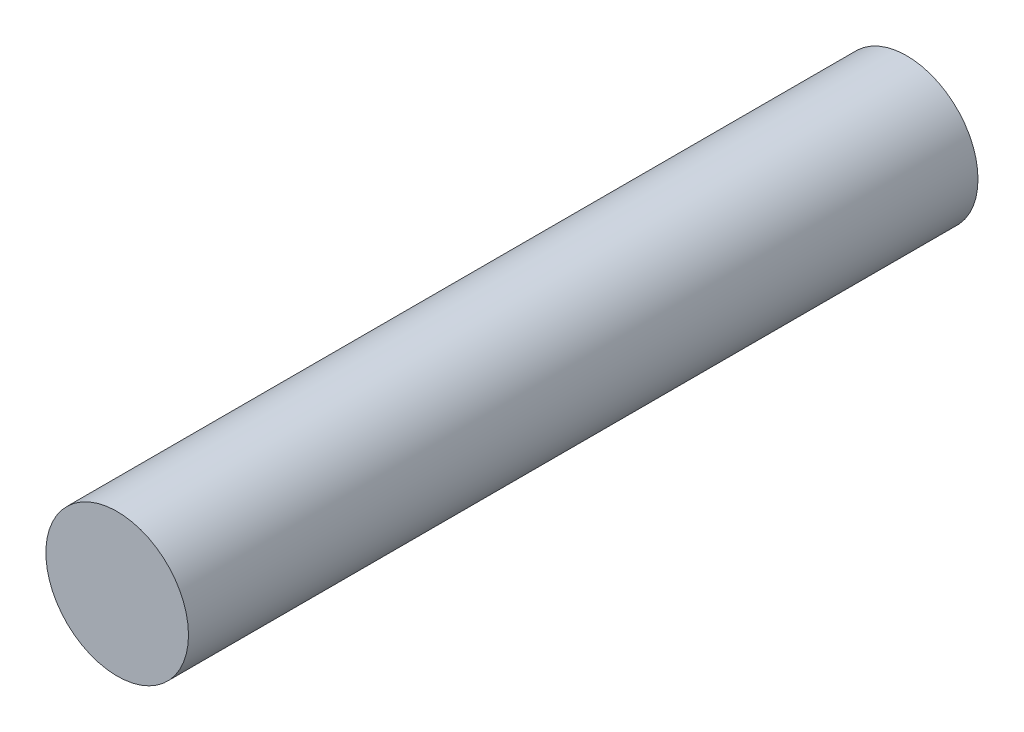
ISO-10303-21;
HEADER;
FILE_DESCRIPTION(('STEP AP214'),'2;1');
FILE_NAME('part.step','',(''),(''),'','','');
FILE_SCHEMA(('AUTOMOTIVE_DESIGN { 1 0 10303 214 1 1 1 1 }'));
ENDSEC;
DATA;
#1=APPLICATION_CONTEXT('core data for automotive mechanical design processes');
#2=APPLICATION_PROTOCOL_DEFINITION('international standard','automotive_design',2000,#1);
#3=PRODUCT_CONTEXT('',#1,'mechanical');
#4=PRODUCT('Part','Part','',(#3));
#5=PRODUCT_RELATED_PRODUCT_CATEGORY('part','',(#4));
#6=PRODUCT_DEFINITION_FORMATION('','',#4);
#7=PRODUCT_DEFINITION_CONTEXT('part definition',#1,'design');
#8=PRODUCT_DEFINITION('design','',#6,#7);
#9=PRODUCT_DEFINITION_SHAPE('','',#8);
#10=(LENGTH_UNIT() NAMED_UNIT(*) SI_UNIT(.MILLI.,.METRE.));
#11=(NAMED_UNIT(*) PLANE_ANGLE_UNIT() SI_UNIT($,.RADIAN.));
#12=(NAMED_UNIT(*) SI_UNIT($,.STERADIAN.) SOLID_ANGLE_UNIT());
#13=UNCERTAINTY_MEASURE_WITH_UNIT(LENGTH_MEASURE(1.E-05),#10,'distance_accuracy_value','');
#14=(GEOMETRIC_REPRESENTATION_CONTEXT(3) GLOBAL_UNCERTAINTY_ASSIGNED_CONTEXT((#13)) GLOBAL_UNIT_ASSIGNED_CONTEXT((#10,
#11,#12)) REPRESENTATION_CONTEXT('',''));
#15=CARTESIAN_POINT('',(0.,0.,0.));
#16=DIRECTION('',(0.,0.,1.));
#17=DIRECTION('',(1.,0.,0.));
#18=AXIS2_PLACEMENT_3D('',#15,#16,#17);
#19=CARTESIAN_POINT('',(0.,0.,155.));
#20=DIRECTION('',(0.,0.,-1.));
#21=DIRECTION('',(-1.,0.,0.));
#22=AXIS2_PLACEMENT_3D('',#19,#20,#21);
#23=CYLINDRICAL_SURFACE('',#22,14.);
#24=CARTESIAN_POINT('',(0.,0.,155.));
#25=DIRECTION('',(0.,0.,1.));
#26=DIRECTION('',(1.,0.,0.));
#27=AXIS2_PLACEMENT_3D('',#24,#25,#26);
#28=CIRCLE('',#27,14.);
#29=CARTESIAN_POINT('',(14.,0.,155.));
#30=VERTEX_POINT('',#29);
#31=EDGE_CURVE('E10',#30,#30,#28,.T.);
#32=ORIENTED_EDGE('',*,*,#31,.F.);
#33=EDGE_LOOP('',(#32));
#34=FACE_BOUND('',#33,.T.);
#35=CARTESIAN_POINT('',(0.,0.,0.));
#36=DIRECTION('',(0.,0.,1.));
#37=DIRECTION('',(1.,0.,0.));
#38=AXIS2_PLACEMENT_3D('',#35,#36,#37);
#39=CIRCLE('',#38,14.);
#40=CARTESIAN_POINT('',(14.,0.,0.));
#41=VERTEX_POINT('',#40);
#42=EDGE_CURVE('E40',#41,#41,#39,.T.);
#43=ORIENTED_EDGE('',*,*,#42,.T.);
#44=EDGE_LOOP('',(#43));
#45=FACE_BOUND('',#44,.T.);
#46=ADVANCED_FACE('F37',(#34,#45),#23,.T.);
#47=CARTESIAN_POINT('',(0.,0.,155.));
#48=DIRECTION('',(0.,0.,1.));
#49=DIRECTION('',(1.,0.,0.));
#50=AXIS2_PLACEMENT_3D('',#47,#48,#49);
#51=PLANE('',#50);
#52=ORIENTED_EDGE('',*,*,#31,.T.);
#53=EDGE_LOOP('',(#52));
#54=FACE_BOUND('',#53,.T.);
#55=ADVANCED_FACE('F54',(#54),#51,.T.);
#56=CARTESIAN_POINT('',(0.,0.,0.));
#57=DIRECTION('',(0.,0.,1.));
#58=DIRECTION('',(1.,0.,0.));
#59=AXIS2_PLACEMENT_3D('',#56,#57,#58);
#60=PLANE('',#59);
#61=ORIENTED_EDGE('',*,*,#42,.F.);
#62=EDGE_LOOP('',(#61));
#63=FACE_BOUND('',#62,.T.);
#64=ADVANCED_FACE('F52',(#63),#60,.F.);
#65=CLOSED_SHELL('',(#46,#55,#64));
#66=MANIFOLD_SOLID_BREP('B2',#65);
#67=ADVANCED_BREP_SHAPE_REPRESENTATION('',(#18,#66),#14);
#68=SHAPE_DEFINITION_REPRESENTATION(#9,#67);
ENDSEC;
END-ISO-10303-21;
